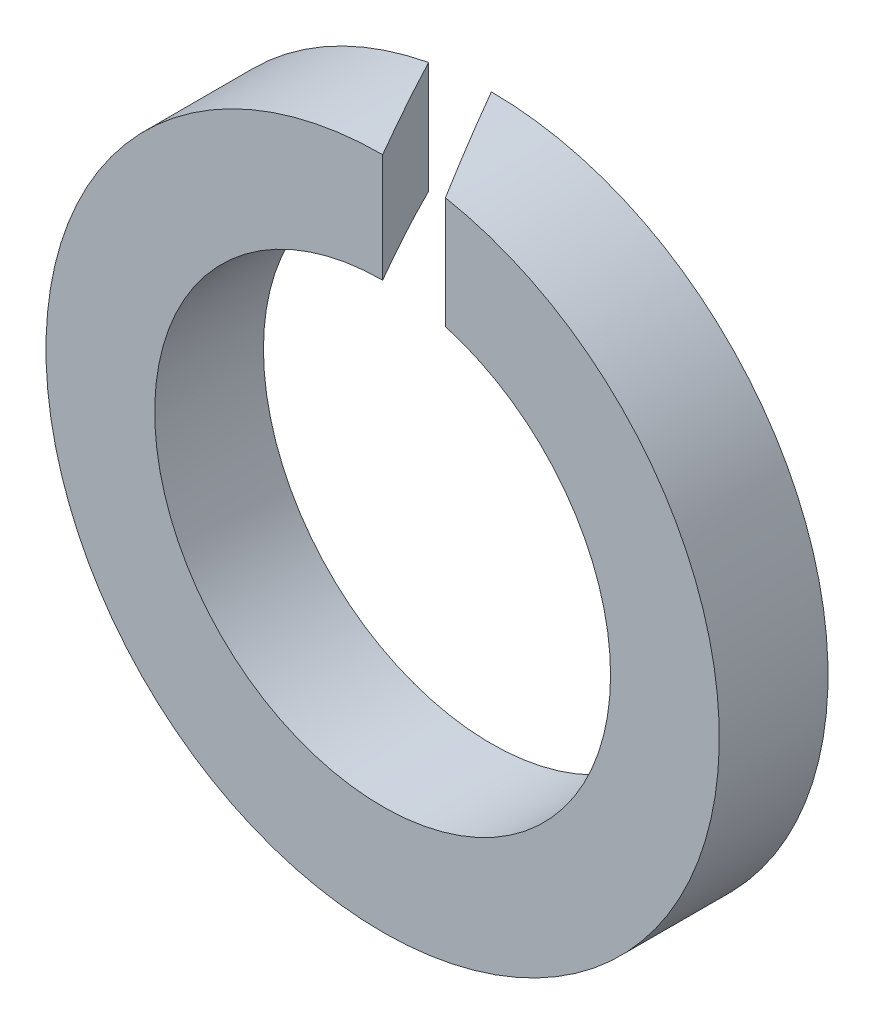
ISO-10303-21;
HEADER;
FILE_DESCRIPTION(('STEP AP214'),'2;1');
FILE_NAME('part.step','',(''),(''),'','','');
FILE_SCHEMA(('AUTOMOTIVE_DESIGN { 1 0 10303 214 1 1 1 1 }'));
ENDSEC;
DATA;
#1=APPLICATION_CONTEXT('core data for automotive mechanical design processes');
#2=APPLICATION_PROTOCOL_DEFINITION('international standard','automotive_design',2000,#1);
#3=PRODUCT_CONTEXT('',#1,'mechanical');
#4=PRODUCT('Part','Part','',(#3));
#5=PRODUCT_RELATED_PRODUCT_CATEGORY('part','',(#4));
#6=PRODUCT_DEFINITION_FORMATION('','',#4);
#7=PRODUCT_DEFINITION_CONTEXT('part definition',#1,'design');
#8=PRODUCT_DEFINITION('design','',#6,#7);
#9=PRODUCT_DEFINITION_SHAPE('','',#8);
#10=(LENGTH_UNIT() NAMED_UNIT(*) SI_UNIT(.MILLI.,.METRE.));
#11=(NAMED_UNIT(*) PLANE_ANGLE_UNIT() SI_UNIT($,.RADIAN.));
#12=(NAMED_UNIT(*) SI_UNIT($,.STERADIAN.) SOLID_ANGLE_UNIT());
#13=UNCERTAINTY_MEASURE_WITH_UNIT(LENGTH_MEASURE(1.E-05),#10,'distance_accuracy_value','');
#14=(GEOMETRIC_REPRESENTATION_CONTEXT(3) GLOBAL_UNCERTAINTY_ASSIGNED_CONTEXT((#13)) GLOBAL_UNIT_ASSIGNED_CONTEXT((#10,
#11,#12)) REPRESENTATION_CONTEXT('',''));
#15=CARTESIAN_POINT('',(0.,0.,0.));
#16=DIRECTION('',(0.,0.,1.));
#17=DIRECTION('',(1.,0.,0.));
#18=AXIS2_PLACEMENT_3D('',#15,#16,#17);
#19=CARTESIAN_POINT('',(0.,0.,-2.6));
#20=DIRECTION('',(0.,0.,1.));
#21=DIRECTION('',(1.,0.,0.));
#22=AXIS2_PLACEMENT_3D('',#19,#20,#21);
#23=CYLINDRICAL_SURFACE('',#22,8.05);
#24=CARTESIAN_POINT('',(0.,0.,0.));
#25=DIRECTION('',(0.,0.,1.));
#26=DIRECTION('',(1.,0.,0.));
#27=AXIS2_PLACEMENT_3D('',#24,#25,#26);
#28=CIRCLE('',#27,8.05);
#29=CARTESIAN_POINT('',(0.,8.05,0.));
#30=VERTEX_POINT('',#29);
#31=CARTESIAN_POINT('',(1.50111069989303,7.90880311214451,0.));
#32=VERTEX_POINT('',#31);
#33=EDGE_CURVE('E83',#30,#32,#28,.T.);
#34=ORIENTED_EDGE('',*,*,#33,.F.);
#35=CARTESIAN_POINT('',(0.,0.,0.));
#36=DIRECTION('',(0.866025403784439,0.,-0.5));
#37=DIRECTION('',(0.5,0.,0.866025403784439));
#38=AXIS2_PLACEMENT_3D('',#35,#36,#37);
#39=ELLIPSE('',#38,16.1,8.05);
#40=CARTESIAN_POINT('',(-1.50111069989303,7.90880311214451,-2.6));
#41=VERTEX_POINT('',#40);
#42=EDGE_CURVE('E67',#30,#41,#39,.F.);
#43=ORIENTED_EDGE('',*,*,#42,.T.);
#44=CARTESIAN_POINT('',(0.,0.,-2.6));
#45=DIRECTION('',(0.,0.,1.));
#46=DIRECTION('',(1.,0.,0.));
#47=AXIS2_PLACEMENT_3D('',#44,#45,#46);
#48=CIRCLE('',#47,8.05);
#49=CARTESIAN_POINT('',(0.,8.05,-2.6));
#50=VERTEX_POINT('',#49);
#51=EDGE_CURVE('E88',#41,#50,#48,.T.);
#52=ORIENTED_EDGE('',*,*,#51,.T.);
#53=CARTESIAN_POINT('',(0.,0.,-2.6));
#54=DIRECTION('',(-0.866025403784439,0.,0.5));
#55=DIRECTION('',(0.5,0.,0.866025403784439));
#56=AXIS2_PLACEMENT_3D('',#53,#54,#55);
#57=ELLIPSE('',#56,16.1,8.05);
#58=EDGE_CURVE('E76',#50,#32,#57,.F.);
#59=ORIENTED_EDGE('',*,*,#58,.T.);
#60=EDGE_LOOP('',(#34,#43,#52,#59));
#61=FACE_BOUND('',#60,.T.);
#62=ADVANCED_FACE('F30',(#61),#23,.T.);
#63=CARTESIAN_POINT('',(0.,0.,-2.6));
#64=DIRECTION('',(0.,0.,1.));
#65=DIRECTION('',(1.,0.,0.));
#66=AXIS2_PLACEMENT_3D('',#63,#64,#65);
#67=PLANE('',#66);
#68=DIRECTION('',(0.,-1.,0.));
#69=VECTOR('',#68,1.);
#70=CARTESIAN_POINT('',(-1.50111069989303,8.05,-2.6));
#71=LINE('',#70,#69);
#72=CARTESIAN_POINT('',(-1.50111069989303,5.23919523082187,-2.6));
#73=VERTEX_POINT('',#72);
#74=EDGE_CURVE('E70',#41,#73,#71,.T.);
#75=ORIENTED_EDGE('',*,*,#74,.T.);
#76=CARTESIAN_POINT('',(0.,0.,-2.6));
#77=DIRECTION('',(0.,0.,1.));
#78=DIRECTION('',(1.,0.,0.));
#79=AXIS2_PLACEMENT_3D('',#76,#77,#78);
#80=CIRCLE('',#79,5.45);
#81=CARTESIAN_POINT('',(0.,5.45,-2.6));
#82=VERTEX_POINT('',#81);
#83=EDGE_CURVE('E89',#73,#82,#80,.T.);
#84=ORIENTED_EDGE('',*,*,#83,.T.);
#85=DIRECTION('',(0.,-1.,0.));
#86=VECTOR('',#85,1.);
#87=CARTESIAN_POINT('',(0.,8.05,-2.6));
#88=LINE('',#87,#86);
#89=EDGE_CURVE('E51',#50,#82,#88,.T.);
#90=ORIENTED_EDGE('',*,*,#89,.F.);
#91=ORIENTED_EDGE('',*,*,#51,.F.);
#92=EDGE_LOOP('',(#75,#84,#90,#91));
#93=FACE_BOUND('',#92,.T.);
#94=ADVANCED_FACE('F104',(#93),#67,.F.);
#95=CARTESIAN_POINT('',(0.,0.,0.));
#96=DIRECTION('',(0.,0.,1.));
#97=DIRECTION('',(1.,0.,0.));
#98=AXIS2_PLACEMENT_3D('',#95,#96,#97);
#99=PLANE('',#98);
#100=CARTESIAN_POINT('',(0.,0.,0.));
#101=DIRECTION('',(0.,0.,1.));
#102=DIRECTION('',(1.,0.,0.));
#103=AXIS2_PLACEMENT_3D('',#100,#101,#102);
#104=CIRCLE('',#103,5.45);
#105=CARTESIAN_POINT('',(0.,5.45,0.));
#106=VERTEX_POINT('',#105);
#107=CARTESIAN_POINT('',(1.50111069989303,5.23919523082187,0.));
#108=VERTEX_POINT('',#107);
#109=EDGE_CURVE('E75',#106,#108,#104,.T.);
#110=ORIENTED_EDGE('',*,*,#109,.F.);
#111=DIRECTION('',(0.,-1.,0.));
#112=VECTOR('',#111,1.);
#113=CARTESIAN_POINT('',(0.,8.05,0.));
#114=LINE('',#113,#112);
#115=EDGE_CURVE('E43',#30,#106,#114,.T.);
#116=ORIENTED_EDGE('',*,*,#115,.F.);
#117=ORIENTED_EDGE('',*,*,#33,.T.);
#118=DIRECTION('',(0.,-1.,0.));
#119=VECTOR('',#118,1.);
#120=CARTESIAN_POINT('',(1.50111069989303,8.05,0.));
#121=LINE('',#120,#119);
#122=EDGE_CURVE('E85',#32,#108,#121,.T.);
#123=ORIENTED_EDGE('',*,*,#122,.T.);
#124=EDGE_LOOP('',(#110,#116,#117,#123));
#125=FACE_BOUND('',#124,.T.);
#126=ADVANCED_FACE('F81',(#125),#99,.T.);
#127=CARTESIAN_POINT('',(0.,0.,-2.6));
#128=DIRECTION('',(0.,0.,1.));
#129=DIRECTION('',(1.,0.,0.));
#130=AXIS2_PLACEMENT_3D('',#127,#128,#129);
#131=CYLINDRICAL_SURFACE('',#130,5.45);
#132=CARTESIAN_POINT('',(0.,0.,0.));
#133=DIRECTION('',(0.866025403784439,0.,-0.5));
#134=DIRECTION('',(0.5,0.,0.866025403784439));
#135=AXIS2_PLACEMENT_3D('',#132,#133,#134);
#136=ELLIPSE('',#135,10.9,5.45);
#137=EDGE_CURVE('E11',#106,#73,#136,.F.);
#138=ORIENTED_EDGE('',*,*,#137,.F.);
#139=ORIENTED_EDGE('',*,*,#109,.T.);
#140=CARTESIAN_POINT('',(0.,0.,-2.6));
#141=DIRECTION('',(-0.866025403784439,0.,0.5));
#142=DIRECTION('',(0.5,0.,0.866025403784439));
#143=AXIS2_PLACEMENT_3D('',#140,#141,#142);
#144=ELLIPSE('',#143,10.9,5.45);
#145=EDGE_CURVE('E37',#82,#108,#144,.F.);
#146=ORIENTED_EDGE('',*,*,#145,.F.);
#147=ORIENTED_EDGE('',*,*,#83,.F.);
#148=EDGE_LOOP('',(#138,#139,#146,#147));
#149=FACE_BOUND('',#148,.T.);
#150=ADVANCED_FACE('F99',(#149),#131,.F.);
#151=CARTESIAN_POINT('',(0.,8.05,-2.6));
#152=DIRECTION('',(-0.866025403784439,0.,0.5));
#153=DIRECTION('',(0.5,0.,0.866025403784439));
#154=AXIS2_PLACEMENT_3D('',#151,#152,#153);
#155=PLANE('',#154);
#156=ORIENTED_EDGE('',*,*,#89,.T.);
#157=ORIENTED_EDGE('',*,*,#145,.T.);
#158=ORIENTED_EDGE('',*,*,#122,.F.);
#159=ORIENTED_EDGE('',*,*,#58,.F.);
#160=EDGE_LOOP('',(#156,#157,#158,#159));
#161=FACE_BOUND('',#160,.T.);
#162=ADVANCED_FACE('F95',(#161),#155,.T.);
#163=CARTESIAN_POINT('',(0.,8.05,0.));
#164=DIRECTION('',(0.866025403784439,0.,-0.5));
#165=DIRECTION('',(-0.5,0.,-0.866025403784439));
#166=AXIS2_PLACEMENT_3D('',#163,#164,#165);
#167=PLANE('',#166);
#168=ORIENTED_EDGE('',*,*,#115,.T.);
#169=ORIENTED_EDGE('',*,*,#137,.T.);
#170=ORIENTED_EDGE('',*,*,#74,.F.);
#171=ORIENTED_EDGE('',*,*,#42,.F.);
#172=EDGE_LOOP('',(#168,#169,#170,#171));
#173=FACE_BOUND('',#172,.T.);
#174=ADVANCED_FACE('F68',(#173),#167,.T.);
#175=CLOSED_SHELL('',(#62,#94,#126,#150,#162,#174));
#176=MANIFOLD_SOLID_BREP('B2',#175);
#177=ADVANCED_BREP_SHAPE_REPRESENTATION('',(#18,#176),#14);
#178=SHAPE_DEFINITION_REPRESENTATION(#9,#177);
ENDSEC;
END-ISO-10303-21;
